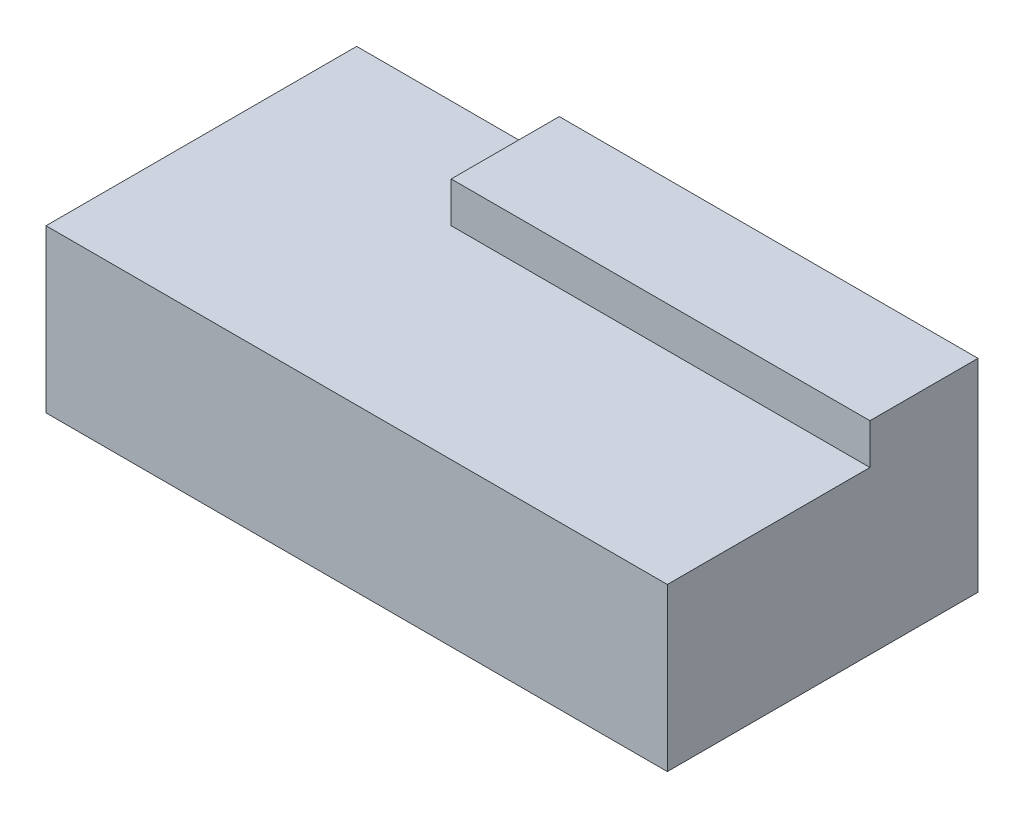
from build123d import *

# Parameters (mm, degrees)
SKETCH1_W           = 230
SKETCH1_H           = 115
BOSS_EXTRUDE1_DEPTH = 37.5
SKETCH2_W           = 75
SKETCH2_H           = 115
CUT_EXTRUDE1_DEPTH  = 15
SKETCH3_W           = 155
SKETCH3_H           = 75
CUT_EXTRUDE2_DEPTH  = 15


with BuildPart() as part:
    # Sketch1 → Boss-Extrude1 (new, symmetric)
    with BuildSketch(Plane(origin=(0, 0, 0), x_dir=(1, 0, 0), z_dir=(0, 1, 0))):
        Rectangle(SKETCH1_W, SKETCH1_H)
    extrude(amount=BOSS_EXTRUDE1_DEPTH, both=True)

    # Sketch2 → Cut-Extrude1 (cut)
    with BuildSketch(Plane(origin=(0, 37.5, 0), x_dir=(1, 0, 0), z_dir=(0, 1, 0))):
        with Locations((-77.5, 0)):
            Rectangle(SKETCH2_W, SKETCH2_H)
    extrude(amount=-CUT_EXTRUDE1_DEPTH, mode=Mode.SUBTRACT)

    # Sketch3 → Cut-Extrude2 (cut)
    with BuildSketch(Plane(origin=(0, 37.5, 0), x_dir=(1, 0, 0), z_dir=(0, 1, 0))):
        with Locations((37.5, -20)):
            Rectangle(SKETCH3_W, SKETCH3_H)
    extrude(amount=-CUT_EXTRUDE2_DEPTH, mode=Mode.SUBTRACT)


solid = part.part
